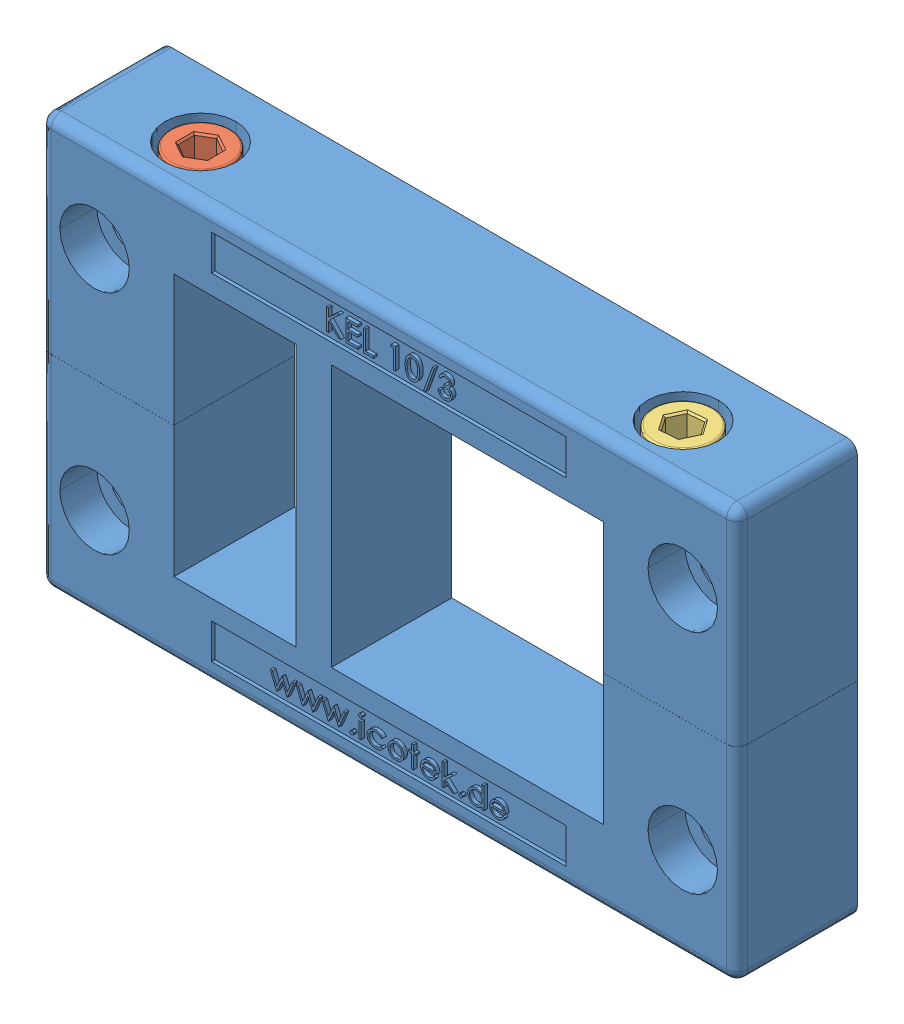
SolidWorks assembly 42212.SLDASM, configuration Default (file format 8000). Lengths in mm.
Overall size (98.3 58 17).
5 component instances, 5 part files, 0 mates.
Components (placement in the parent):
- 42212_01-1: 42212_01.SLDPRT [Default] at origin size (98.3 58 17)
- 42212_02-1: 42212_02.SLDPRT [Default] at origin size (8.5 57 8.5)
- 42212_03-1: 42212_03.SLDPRT [Default] at origin size (8.5 57 8.5)
- 42212_04-1: 42212_04.SLDPRT [Default] at origin size (9.25 4.7 8.01)
- 42212_05-1: 42212_05.SLDPRT [Default] at origin size (9.25 4.7 8.01)
